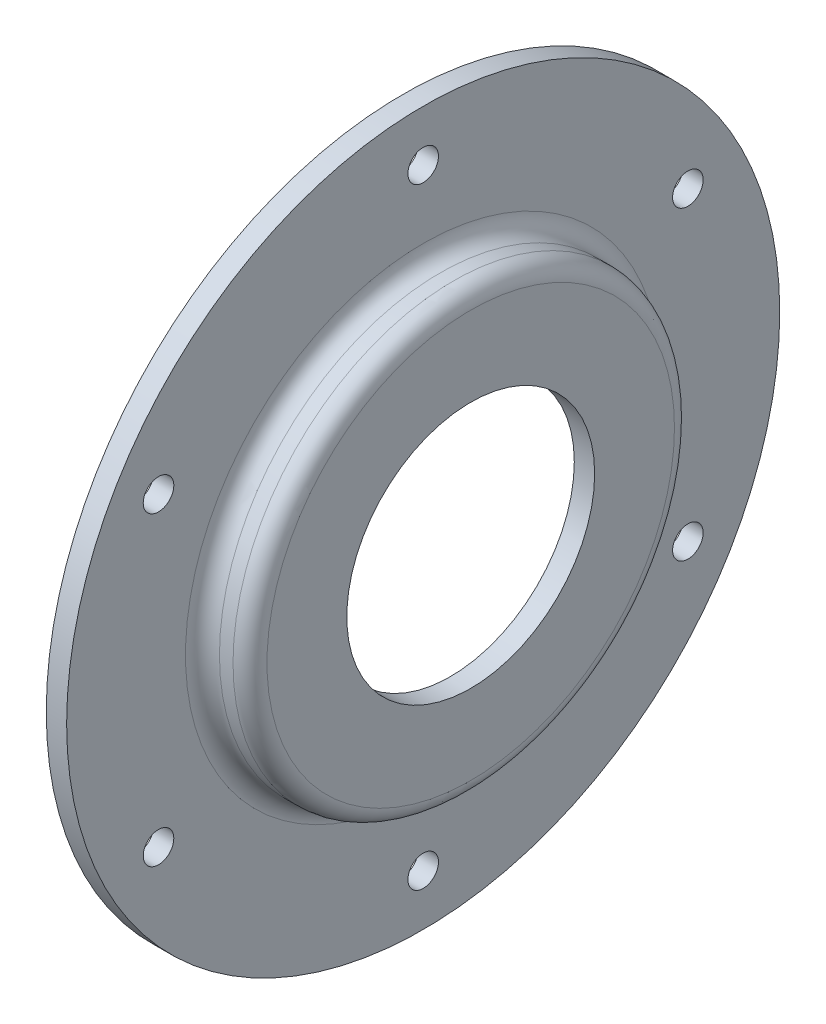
ISO-10303-21;
HEADER;
FILE_DESCRIPTION(('STEP AP214'),'2;1');
FILE_NAME('part.step','',(''),(''),'','','');
FILE_SCHEMA(('AUTOMOTIVE_DESIGN { 1 0 10303 214 1 1 1 1 }'));
ENDSEC;
DATA;
#1=APPLICATION_CONTEXT('core data for automotive mechanical design processes');
#2=APPLICATION_PROTOCOL_DEFINITION('international standard','automotive_design',2000,#1);
#3=PRODUCT_CONTEXT('',#1,'mechanical');
#4=PRODUCT('Part','Part','',(#3));
#5=PRODUCT_RELATED_PRODUCT_CATEGORY('part','',(#4));
#6=PRODUCT_DEFINITION_FORMATION('','',#4);
#7=PRODUCT_DEFINITION_CONTEXT('part definition',#1,'design');
#8=PRODUCT_DEFINITION('design','',#6,#7);
#9=PRODUCT_DEFINITION_SHAPE('','',#8);
#10=(LENGTH_UNIT() NAMED_UNIT(*) SI_UNIT(.MILLI.,.METRE.));
#11=(NAMED_UNIT(*) PLANE_ANGLE_UNIT() SI_UNIT($,.RADIAN.));
#12=(NAMED_UNIT(*) SI_UNIT($,.STERADIAN.) SOLID_ANGLE_UNIT());
#13=UNCERTAINTY_MEASURE_WITH_UNIT(LENGTH_MEASURE(1.E-05),#10,'distance_accuracy_value','');
#14=(GEOMETRIC_REPRESENTATION_CONTEXT(3) GLOBAL_UNCERTAINTY_ASSIGNED_CONTEXT((#13)) GLOBAL_UNIT_ASSIGNED_CONTEXT((#10,
#11,#12)) REPRESENTATION_CONTEXT('',''));
#15=CARTESIAN_POINT('',(0.,0.,0.));
#16=DIRECTION('',(0.,0.,1.));
#17=DIRECTION('',(1.,0.,0.));
#18=AXIS2_PLACEMENT_3D('',#15,#16,#17);
#19=CARTESIAN_POINT('',(-14.,105.,0.));
#20=DIRECTION('',(-1.,0.,0.));
#21=DIRECTION('',(0.,0.,1.));
#22=AXIS2_PLACEMENT_3D('',#19,#20,#21);
#23=PLANE('',#22);
#24=CARTESIAN_POINT('',(-14.,-45.0000000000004,77.9422863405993));
#25=DIRECTION('',(1.,0.,0.));
#26=DIRECTION('',(0.,0.866025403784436,0.500000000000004));
#27=AXIS2_PLACEMENT_3D('',#24,#25,#26);
#28=CIRCLE('',#27,4.5);
#29=CARTESIAN_POINT('',(-14.,-41.1028856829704,80.1922863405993));
#30=VERTEX_POINT('',#29);
#31=EDGE_CURVE('E77',#30,#30,#28,.T.);
#32=ORIENTED_EDGE('',*,*,#31,.T.);
#33=EDGE_LOOP('',(#32));
#34=FACE_BOUND('',#33,.T.);
#35=CARTESIAN_POINT('',(-14.,-90.,0.));
#36=DIRECTION('',(1.,0.,0.));
#37=DIRECTION('',(0.,0.,1.));
#38=AXIS2_PLACEMENT_3D('',#35,#36,#37);
#39=CIRCLE('',#38,4.5);
#40=CARTESIAN_POINT('',(-14.,-90.,4.5));
#41=VERTEX_POINT('',#40);
#42=EDGE_CURVE('E95',#41,#41,#39,.T.);
#43=ORIENTED_EDGE('',*,*,#42,.T.);
#44=EDGE_LOOP('',(#43));
#45=FACE_BOUND('',#44,.T.);
#46=CARTESIAN_POINT('',(-14.,-44.9999999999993,-77.9422863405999));
#47=DIRECTION('',(1.,0.,0.));
#48=DIRECTION('',(0.,-0.866025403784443,0.499999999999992));
#49=AXIS2_PLACEMENT_3D('',#46,#47,#48);
#50=CIRCLE('',#49,4.5);
#51=CARTESIAN_POINT('',(-14.,-48.8971143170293,-75.6922863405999));
#52=VERTEX_POINT('',#51);
#53=EDGE_CURVE('E89',#52,#52,#50,.T.);
#54=ORIENTED_EDGE('',*,*,#53,.T.);
#55=EDGE_LOOP('',(#54));
#56=FACE_BOUND('',#55,.T.);
#57=CARTESIAN_POINT('',(-14.,45.0000000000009,-77.942286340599));
#58=DIRECTION('',(1.,0.,0.));
#59=DIRECTION('',(0.,-0.866025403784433,-0.50000000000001));
#60=AXIS2_PLACEMENT_3D('',#57,#58,#59);
#61=CIRCLE('',#60,4.5);
#62=CARTESIAN_POINT('',(-14.,41.102885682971,-80.192286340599));
#63=VERTEX_POINT('',#62);
#64=EDGE_CURVE('E83',#63,#63,#61,.T.);
#65=ORIENTED_EDGE('',*,*,#64,.T.);
#66=EDGE_LOOP('',(#65));
#67=FACE_BOUND('',#66,.T.);
#68=CARTESIAN_POINT('',(-14.,44.9999999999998,77.9422863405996));
#69=DIRECTION('',(1.,0.,0.));
#70=DIRECTION('',(0.,0.86602540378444,-0.499999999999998));
#71=AXIS2_PLACEMENT_3D('',#68,#69,#70);
#72=CIRCLE('',#71,4.5);
#73=CARTESIAN_POINT('',(-14.,48.8971143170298,75.6922863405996));
#74=VERTEX_POINT('',#73);
#75=EDGE_CURVE('E71',#74,#74,#72,.T.);
#76=ORIENTED_EDGE('',*,*,#75,.T.);
#77=EDGE_LOOP('',(#76));
#78=FACE_BOUND('',#77,.T.);
#79=CARTESIAN_POINT('',(-14.,90.,0.));
#80=DIRECTION('',(1.,0.,0.));
#81=DIRECTION('',(0.,0.,-1.));
#82=AXIS2_PLACEMENT_3D('',#79,#80,#81);
#83=CIRCLE('',#82,4.5);
#84=CARTESIAN_POINT('',(-14.,90.,-4.5));
#85=VERTEX_POINT('',#84);
#86=EDGE_CURVE('E67',#85,#85,#83,.T.);
#87=ORIENTED_EDGE('',*,*,#86,.T.);
#88=EDGE_LOOP('',(#87));
#89=FACE_BOUND('',#88,.T.);
#90=CARTESIAN_POINT('',(-14.,0.,0.));
#91=DIRECTION('',(1.,0.,0.));
#92=DIRECTION('',(0.,0.,-1.));
#93=AXIS2_PLACEMENT_3D('',#90,#91,#92);
#94=CIRCLE('',#93,59.);
#95=CARTESIAN_POINT('',(-14.,0.,-59.));
#96=VERTEX_POINT('',#95);
#97=EDGE_CURVE('E64',#96,#96,#94,.T.);
#98=ORIENTED_EDGE('',*,*,#97,.T.);
#99=EDGE_LOOP('',(#98));
#100=FACE_BOUND('',#99,.T.);
#101=CARTESIAN_POINT('',(-14.,0.,0.));
#102=DIRECTION('',(1.,0.,0.));
#103=DIRECTION('',(0.,0.,-1.));
#104=AXIS2_PLACEMENT_3D('',#101,#102,#103);
#105=CIRCLE('',#104,105.);
#106=CARTESIAN_POINT('',(-14.,0.,-105.));
#107=VERTEX_POINT('',#106);
#108=EDGE_CURVE('E10',#107,#107,#105,.T.);
#109=ORIENTED_EDGE('',*,*,#108,.F.);
#110=EDGE_LOOP('',(#109));
#111=FACE_BOUND('',#110,.T.);
#112=ADVANCED_FACE('F30',(#34,#45,#56,#67,#78,#89,#100,#111),#23,.T.);
#113=CARTESIAN_POINT('',(0.,0.,0.));
#114=DIRECTION('',(1.,0.,0.));
#115=DIRECTION('',(0.,0.,-1.));
#116=AXIS2_PLACEMENT_3D('',#113,#114,#115);
#117=CYLINDRICAL_SURFACE('',#116,105.);
#118=ORIENTED_EDGE('',*,*,#108,.T.);
#119=EDGE_LOOP('',(#118));
#120=FACE_BOUND('',#119,.T.);
#121=CARTESIAN_POINT('',(-8.,0.,0.));
#122=DIRECTION('',(1.,0.,0.));
#123=DIRECTION('',(0.,0.,-1.));
#124=AXIS2_PLACEMENT_3D('',#121,#122,#123);
#125=CIRCLE('',#124,105.);
#126=CARTESIAN_POINT('',(-8.,0.,-105.));
#127=VERTEX_POINT('',#126);
#128=EDGE_CURVE('E36',#127,#127,#125,.T.);
#129=ORIENTED_EDGE('',*,*,#128,.F.);
#130=EDGE_LOOP('',(#129));
#131=FACE_BOUND('',#130,.T.);
#132=ADVANCED_FACE('F117',(#120,#131),#117,.T.);
#133=CARTESIAN_POINT('',(-8.,105.,0.));
#134=DIRECTION('',(1.,0.,0.));
#135=DIRECTION('',(0.,0.,-1.));
#136=AXIS2_PLACEMENT_3D('',#133,#134,#135);
#137=PLANE('',#136);
#138=CARTESIAN_POINT('',(-8.,-45.0000000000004,77.9422863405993));
#139=DIRECTION('',(1.,0.,0.));
#140=DIRECTION('',(0.,0.866025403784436,0.500000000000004));
#141=AXIS2_PLACEMENT_3D('',#138,#139,#140);
#142=CIRCLE('',#141,4.5);
#143=CARTESIAN_POINT('',(-8.,-41.1028856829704,80.1922863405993));
#144=VERTEX_POINT('',#143);
#145=EDGE_CURVE('E98',#144,#144,#142,.T.);
#146=ORIENTED_EDGE('',*,*,#145,.F.);
#147=EDGE_LOOP('',(#146));
#148=FACE_BOUND('',#147,.T.);
#149=CARTESIAN_POINT('',(-8.,-90.,0.));
#150=DIRECTION('',(1.,0.,0.));
#151=DIRECTION('',(0.,0.,1.));
#152=AXIS2_PLACEMENT_3D('',#149,#150,#151);
#153=CIRCLE('',#152,4.5);
#154=CARTESIAN_POINT('',(-8.,-90.,4.5));
#155=VERTEX_POINT('',#154);
#156=EDGE_CURVE('E92',#155,#155,#153,.T.);
#157=ORIENTED_EDGE('',*,*,#156,.F.);
#158=EDGE_LOOP('',(#157));
#159=FACE_BOUND('',#158,.T.);
#160=CARTESIAN_POINT('',(-8.,-44.9999999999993,-77.9422863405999));
#161=DIRECTION('',(1.,0.,0.));
#162=DIRECTION('',(0.,-0.866025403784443,0.499999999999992));
#163=AXIS2_PLACEMENT_3D('',#160,#161,#162);
#164=CIRCLE('',#163,4.5);
#165=CARTESIAN_POINT('',(-8.,-48.8971143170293,-75.6922863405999));
#166=VERTEX_POINT('',#165);
#167=EDGE_CURVE('E86',#166,#166,#164,.T.);
#168=ORIENTED_EDGE('',*,*,#167,.F.);
#169=EDGE_LOOP('',(#168));
#170=FACE_BOUND('',#169,.T.);
#171=CARTESIAN_POINT('',(-8.,45.0000000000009,-77.942286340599));
#172=DIRECTION('',(1.,0.,0.));
#173=DIRECTION('',(0.,-0.866025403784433,-0.50000000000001));
#174=AXIS2_PLACEMENT_3D('',#171,#172,#173);
#175=CIRCLE('',#174,4.5);
#176=CARTESIAN_POINT('',(-8.,41.102885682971,-80.192286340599));
#177=VERTEX_POINT('',#176);
#178=EDGE_CURVE('E80',#177,#177,#175,.T.);
#179=ORIENTED_EDGE('',*,*,#178,.F.);
#180=EDGE_LOOP('',(#179));
#181=FACE_BOUND('',#180,.T.);
#182=CARTESIAN_POINT('',(-8.,44.9999999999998,77.9422863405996));
#183=DIRECTION('',(1.,0.,0.));
#184=DIRECTION('',(0.,0.86602540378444,-0.499999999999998));
#185=AXIS2_PLACEMENT_3D('',#182,#183,#184);
#186=CIRCLE('',#185,4.5);
#187=CARTESIAN_POINT('',(-8.,48.8971143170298,75.6922863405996));
#188=VERTEX_POINT('',#187);
#189=EDGE_CURVE('E74',#188,#188,#186,.T.);
#190=ORIENTED_EDGE('',*,*,#189,.F.);
#191=EDGE_LOOP('',(#190));
#192=FACE_BOUND('',#191,.T.);
#193=CARTESIAN_POINT('',(-8.,90.,0.));
#194=DIRECTION('',(1.,0.,0.));
#195=DIRECTION('',(0.,0.,-1.));
#196=AXIS2_PLACEMENT_3D('',#193,#194,#195);
#197=CIRCLE('',#196,4.5);
#198=CARTESIAN_POINT('',(-8.,90.,-4.5));
#199=VERTEX_POINT('',#198);
#200=EDGE_CURVE('E68',#199,#199,#197,.T.);
#201=ORIENTED_EDGE('',*,*,#200,.F.);
#202=EDGE_LOOP('',(#201));
#203=FACE_BOUND('',#202,.T.);
#204=ORIENTED_EDGE('',*,*,#128,.T.);
#205=EDGE_LOOP('',(#204));
#206=FACE_BOUND('',#205,.T.);
#207=CARTESIAN_POINT('',(-8.,0.,0.));
#208=DIRECTION('',(1.,0.,0.));
#209=DIRECTION('',(0.,0.,-1.));
#210=AXIS2_PLACEMENT_3D('',#207,#208,#209);
#211=CIRCLE('',#210,70.);
#212=CARTESIAN_POINT('',(-8.,0.,-70.));
#213=VERTEX_POINT('',#212);
#214=EDGE_CURVE('E40',#213,#213,#211,.T.);
#215=ORIENTED_EDGE('',*,*,#214,.F.);
#216=EDGE_LOOP('',(#215));
#217=FACE_BOUND('',#216,.T.);
#218=ADVANCED_FACE('F113',(#148,#159,#170,#181,#192,#203,#206,#217),#137,.T.);
#219=CARTESIAN_POINT('',(-3.,0.,0.));
#220=DIRECTION('',(1.,0.,0.));
#221=DIRECTION('',(0.,0.,-1.));
#222=AXIS2_PLACEMENT_3D('',#219,#220,#221);
#223=TOROIDAL_SURFACE('',#222,70.,5.);
#224=ORIENTED_EDGE('',*,*,#214,.T.);
#225=EDGE_LOOP('',(#224));
#226=FACE_BOUND('',#225,.T.);
#227=CARTESIAN_POINT('',(-2.99999999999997,0.,0.));
#228=DIRECTION('',(1.,0.,0.));
#229=DIRECTION('',(0.,0.,-1.));
#230=AXIS2_PLACEMENT_3D('',#227,#228,#229);
#231=CIRCLE('',#230,65.);
#232=CARTESIAN_POINT('',(-2.99999999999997,0.,-65.));
#233=VERTEX_POINT('',#232);
#234=EDGE_CURVE('E44',#233,#233,#231,.T.);
#235=ORIENTED_EDGE('',*,*,#234,.F.);
#236=EDGE_LOOP('',(#235));
#237=FACE_BOUND('',#236,.T.);
#238=ADVANCED_FACE('F116',(#226,#237),#223,.F.);
#239=CARTESIAN_POINT('',(0.,0.,0.));
#240=DIRECTION('',(1.,0.,0.));
#241=DIRECTION('',(0.,0.,-1.));
#242=AXIS2_PLACEMENT_3D('',#239,#240,#241);
#243=CYLINDRICAL_SURFACE('',#242,65.);
#244=ORIENTED_EDGE('',*,*,#234,.T.);
#245=EDGE_LOOP('',(#244));
#246=FACE_BOUND('',#245,.T.);
#247=CARTESIAN_POINT('',(0.999999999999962,0.,0.));
#248=DIRECTION('',(1.,0.,0.));
#249=DIRECTION('',(0.,0.,-1.));
#250=AXIS2_PLACEMENT_3D('',#247,#248,#249);
#251=CIRCLE('',#250,65.);
#252=CARTESIAN_POINT('',(0.999999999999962,0.,-65.));
#253=VERTEX_POINT('',#252);
#254=EDGE_CURVE('E49',#253,#253,#251,.T.);
#255=ORIENTED_EDGE('',*,*,#254,.F.);
#256=EDGE_LOOP('',(#255));
#257=FACE_BOUND('',#256,.T.);
#258=ADVANCED_FACE('F133',(#246,#257),#243,.T.);
#259=CARTESIAN_POINT('',(0.999999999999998,0.,0.));
#260=DIRECTION('',(1.,0.,0.));
#261=DIRECTION('',(0.,0.,-1.));
#262=AXIS2_PLACEMENT_3D('',#259,#260,#261);
#263=TOROIDAL_SURFACE('',#262,60.,5.);
#264=ORIENTED_EDGE('',*,*,#254,.T.);
#265=EDGE_LOOP('',(#264));
#266=FACE_BOUND('',#265,.T.);
#267=CARTESIAN_POINT('',(6.,0.,0.));
#268=DIRECTION('',(1.,0.,0.));
#269=DIRECTION('',(0.,0.,-1.));
#270=AXIS2_PLACEMENT_3D('',#267,#268,#269);
#271=CIRCLE('',#270,60.);
#272=CARTESIAN_POINT('',(6.,0.,-60.));
#273=VERTEX_POINT('',#272);
#274=EDGE_CURVE('E52',#273,#273,#271,.T.);
#275=ORIENTED_EDGE('',*,*,#274,.F.);
#276=EDGE_LOOP('',(#275));
#277=FACE_BOUND('',#276,.T.);
#278=ADVANCED_FACE('F139',(#266,#277),#263,.T.);
#279=CARTESIAN_POINT('',(6.,60.,0.));
#280=DIRECTION('',(1.,0.,0.));
#281=DIRECTION('',(0.,0.,-1.));
#282=AXIS2_PLACEMENT_3D('',#279,#280,#281);
#283=PLANE('',#282);
#284=ORIENTED_EDGE('',*,*,#274,.T.);
#285=EDGE_LOOP('',(#284));
#286=FACE_BOUND('',#285,.T.);
#287=CARTESIAN_POINT('',(6.,0.,0.));
#288=DIRECTION('',(1.,0.,0.));
#289=DIRECTION('',(0.,0.,-1.));
#290=AXIS2_PLACEMENT_3D('',#287,#288,#289);
#291=CIRCLE('',#290,36.5);
#292=CARTESIAN_POINT('',(6.,0.,-36.5));
#293=VERTEX_POINT('',#292);
#294=EDGE_CURVE('E55',#293,#293,#291,.T.);
#295=ORIENTED_EDGE('',*,*,#294,.F.);
#296=EDGE_LOOP('',(#295));
#297=FACE_BOUND('',#296,.T.);
#298=ADVANCED_FACE('F145',(#286,#297),#283,.T.);
#299=CARTESIAN_POINT('',(0.,0.,0.));
#300=DIRECTION('',(1.,0.,0.));
#301=DIRECTION('',(0.,0.,-1.));
#302=AXIS2_PLACEMENT_3D('',#299,#300,#301);
#303=CYLINDRICAL_SURFACE('',#302,36.5);
#304=ORIENTED_EDGE('',*,*,#294,.T.);
#305=EDGE_LOOP('',(#304));
#306=FACE_BOUND('',#305,.T.);
#307=CARTESIAN_POINT('',(0.,0.,0.));
#308=DIRECTION('',(1.,0.,0.));
#309=DIRECTION('',(0.,0.,-1.));
#310=AXIS2_PLACEMENT_3D('',#307,#308,#309);
#311=CIRCLE('',#310,36.5);
#312=CARTESIAN_POINT('',(0.,0.,-36.5));
#313=VERTEX_POINT('',#312);
#314=EDGE_CURVE('E58',#313,#313,#311,.T.);
#315=ORIENTED_EDGE('',*,*,#314,.F.);
#316=EDGE_LOOP('',(#315));
#317=FACE_BOUND('',#316,.T.);
#318=ADVANCED_FACE('F151',(#306,#317),#303,.F.);
#319=CARTESIAN_POINT('',(0.,59.,0.));
#320=DIRECTION('',(-1.,0.,0.));
#321=DIRECTION('',(0.,0.,1.));
#322=AXIS2_PLACEMENT_3D('',#319,#320,#321);
#323=PLANE('',#322);
#324=ORIENTED_EDGE('',*,*,#314,.T.);
#325=EDGE_LOOP('',(#324));
#326=FACE_BOUND('',#325,.T.);
#327=CARTESIAN_POINT('',(0.,0.,0.));
#328=DIRECTION('',(1.,0.,0.));
#329=DIRECTION('',(0.,0.,-1.));
#330=AXIS2_PLACEMENT_3D('',#327,#328,#329);
#331=CIRCLE('',#330,59.);
#332=CARTESIAN_POINT('',(0.,0.,-59.));
#333=VERTEX_POINT('',#332);
#334=EDGE_CURVE('E61',#333,#333,#331,.T.);
#335=ORIENTED_EDGE('',*,*,#334,.F.);
#336=EDGE_LOOP('',(#335));
#337=FACE_BOUND('',#336,.T.);
#338=ADVANCED_FACE('F157',(#326,#337),#323,.T.);
#339=CARTESIAN_POINT('',(0.,0.,0.));
#340=DIRECTION('',(1.,0.,0.));
#341=DIRECTION('',(0.,0.,-1.));
#342=AXIS2_PLACEMENT_3D('',#339,#340,#341);
#343=CYLINDRICAL_SURFACE('',#342,59.);
#344=ORIENTED_EDGE('',*,*,#334,.T.);
#345=EDGE_LOOP('',(#344));
#346=FACE_BOUND('',#345,.T.);
#347=ORIENTED_EDGE('',*,*,#97,.F.);
#348=EDGE_LOOP('',(#347));
#349=FACE_BOUND('',#348,.T.);
#350=ADVANCED_FACE('F163',(#346,#349),#343,.F.);
#351=CARTESIAN_POINT('',(-14.,90.,0.));
#352=DIRECTION('',(1.,0.,0.));
#353=DIRECTION('',(0.,0.,-1.));
#354=AXIS2_PLACEMENT_3D('',#351,#352,#353);
#355=CYLINDRICAL_SURFACE('',#354,4.5);
#356=ORIENTED_EDGE('',*,*,#86,.F.);
#357=EDGE_LOOP('',(#356));
#358=FACE_BOUND('',#357,.T.);
#359=ORIENTED_EDGE('',*,*,#200,.T.);
#360=EDGE_LOOP('',(#359));
#361=FACE_BOUND('',#360,.T.);
#362=ADVANCED_FACE('F169',(#358,#361),#355,.F.);
#363=CARTESIAN_POINT('',(-14.,44.9999999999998,77.9422863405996));
#364=DIRECTION('',(1.,0.,0.));
#365=DIRECTION('',(0.,0.,-1.));
#366=AXIS2_PLACEMENT_3D('',#363,#364,#365);
#367=CYLINDRICAL_SURFACE('',#366,4.5);
#368=ORIENTED_EDGE('',*,*,#75,.F.);
#369=EDGE_LOOP('',(#368));
#370=FACE_BOUND('',#369,.T.);
#371=ORIENTED_EDGE('',*,*,#189,.T.);
#372=EDGE_LOOP('',(#371));
#373=FACE_BOUND('',#372,.T.);
#374=ADVANCED_FACE('F184',(#370,#373),#367,.F.);
#375=CARTESIAN_POINT('',(-14.,45.0000000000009,-77.942286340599));
#376=DIRECTION('',(1.,0.,0.));
#377=DIRECTION('',(0.,0.,-1.));
#378=AXIS2_PLACEMENT_3D('',#375,#376,#377);
#379=CYLINDRICAL_SURFACE('',#378,4.5);
#380=ORIENTED_EDGE('',*,*,#64,.F.);
#381=EDGE_LOOP('',(#380));
#382=FACE_BOUND('',#381,.T.);
#383=ORIENTED_EDGE('',*,*,#178,.T.);
#384=EDGE_LOOP('',(#383));
#385=FACE_BOUND('',#384,.T.);
#386=ADVANCED_FACE('F188',(#382,#385),#379,.F.);
#387=CARTESIAN_POINT('',(-14.,-44.9999999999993,-77.9422863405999));
#388=DIRECTION('',(1.,0.,0.));
#389=DIRECTION('',(0.,0.,-1.));
#390=AXIS2_PLACEMENT_3D('',#387,#388,#389);
#391=CYLINDRICAL_SURFACE('',#390,4.5);
#392=ORIENTED_EDGE('',*,*,#53,.F.);
#393=EDGE_LOOP('',(#392));
#394=FACE_BOUND('',#393,.T.);
#395=ORIENTED_EDGE('',*,*,#167,.T.);
#396=EDGE_LOOP('',(#395));
#397=FACE_BOUND('',#396,.T.);
#398=ADVANCED_FACE('F192',(#394,#397),#391,.F.);
#399=CARTESIAN_POINT('',(-14.,-90.,0.));
#400=DIRECTION('',(1.,0.,0.));
#401=DIRECTION('',(0.,0.,-1.));
#402=AXIS2_PLACEMENT_3D('',#399,#400,#401);
#403=CYLINDRICAL_SURFACE('',#402,4.5);
#404=ORIENTED_EDGE('',*,*,#42,.F.);
#405=EDGE_LOOP('',(#404));
#406=FACE_BOUND('',#405,.T.);
#407=ORIENTED_EDGE('',*,*,#156,.T.);
#408=EDGE_LOOP('',(#407));
#409=FACE_BOUND('',#408,.T.);
#410=ADVANCED_FACE('F109',(#406,#409),#403,.F.);
#411=CARTESIAN_POINT('',(-14.,-45.0000000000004,77.9422863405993));
#412=DIRECTION('',(1.,0.,0.));
#413=DIRECTION('',(0.,0.,-1.));
#414=AXIS2_PLACEMENT_3D('',#411,#412,#413);
#415=CYLINDRICAL_SURFACE('',#414,4.5);
#416=ORIENTED_EDGE('',*,*,#31,.F.);
#417=EDGE_LOOP('',(#416));
#418=FACE_BOUND('',#417,.T.);
#419=ORIENTED_EDGE('',*,*,#145,.T.);
#420=EDGE_LOOP('',(#419));
#421=FACE_BOUND('',#420,.T.);
#422=ADVANCED_FACE('F106',(#418,#421),#415,.F.);
#423=CLOSED_SHELL('',(#112,#132,#218,#238,#258,#278,#298,#318,#338,#350,#362,#374,#386,#398,
#410,#422));
#424=MANIFOLD_SOLID_BREP('B2',#423);
#425=ADVANCED_BREP_SHAPE_REPRESENTATION('',(#18,#424),#14);
#426=SHAPE_DEFINITION_REPRESENTATION(#9,#425);
ENDSEC;
END-ISO-10303-21;
